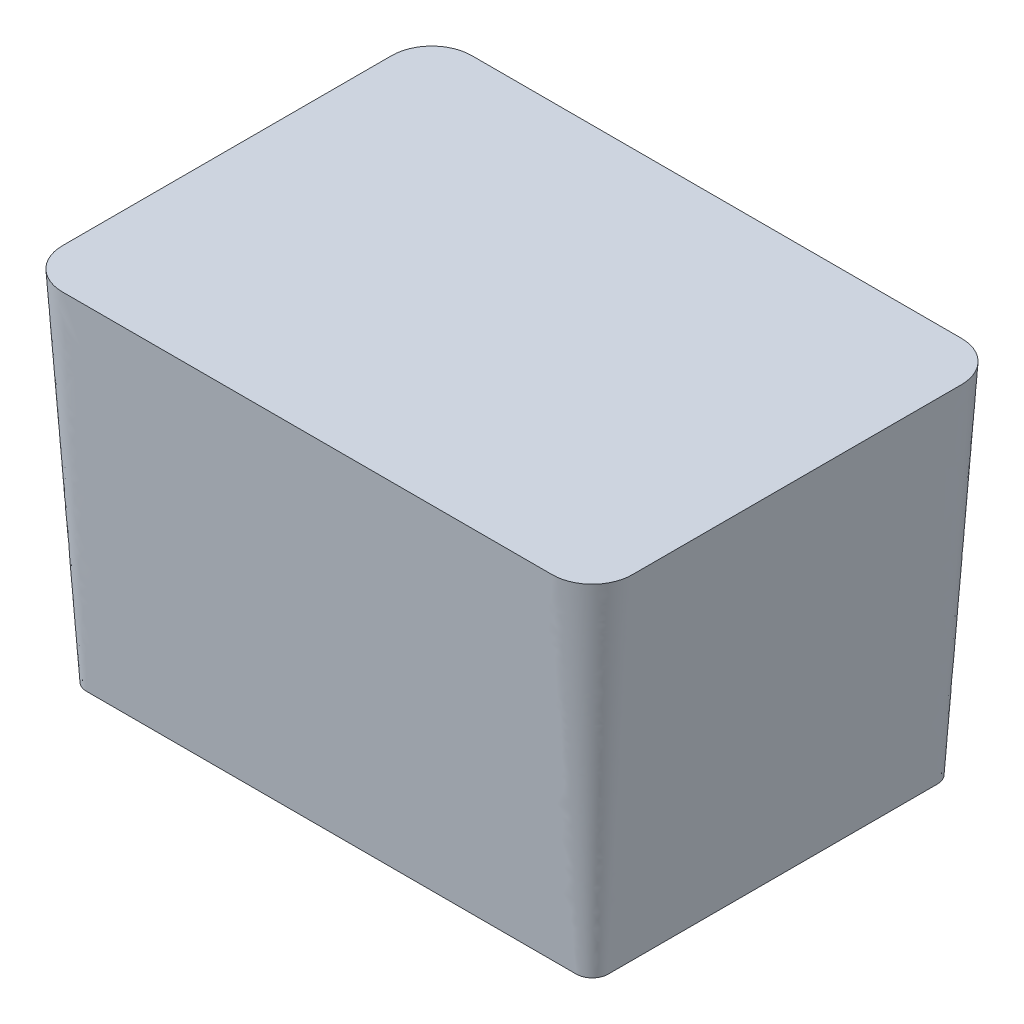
ISO-10303-21;
HEADER;
FILE_DESCRIPTION(('STEP AP214'),'2;1');
FILE_NAME('part.step','',(''),(''),'','','');
FILE_SCHEMA(('AUTOMOTIVE_DESIGN { 1 0 10303 214 1 1 1 1 }'));
ENDSEC;
DATA;
#1=APPLICATION_CONTEXT('core data for automotive mechanical design processes');
#2=APPLICATION_PROTOCOL_DEFINITION('international standard','automotive_design',2000,#1);
#3=PRODUCT_CONTEXT('',#1,'mechanical');
#4=PRODUCT('Part','Part','',(#3));
#5=PRODUCT_RELATED_PRODUCT_CATEGORY('part','',(#4));
#6=PRODUCT_DEFINITION_FORMATION('','',#4);
#7=PRODUCT_DEFINITION_CONTEXT('part definition',#1,'design');
#8=PRODUCT_DEFINITION('design','',#6,#7);
#9=PRODUCT_DEFINITION_SHAPE('','',#8);
#10=(LENGTH_UNIT() NAMED_UNIT(*) SI_UNIT(.MILLI.,.METRE.));
#11=(NAMED_UNIT(*) PLANE_ANGLE_UNIT() SI_UNIT($,.RADIAN.));
#12=(NAMED_UNIT(*) SI_UNIT($,.STERADIAN.) SOLID_ANGLE_UNIT());
#13=UNCERTAINTY_MEASURE_WITH_UNIT(LENGTH_MEASURE(1.E-05),#10,'distance_accuracy_value','');
#14=(GEOMETRIC_REPRESENTATION_CONTEXT(3) GLOBAL_UNCERTAINTY_ASSIGNED_CONTEXT((#13)) GLOBAL_UNIT_ASSIGNED_CONTEXT((#10,
#11,#12)) REPRESENTATION_CONTEXT('',''));
#15=CARTESIAN_POINT('',(0.,0.,0.));
#16=DIRECTION('',(0.,0.,1.));
#17=DIRECTION('',(1.,0.,0.));
#18=AXIS2_PLACEMENT_3D('',#15,#16,#17);
#19=CARTESIAN_POINT('',(193.675,283.21,-130.175));
#20=DIRECTION('',(0.,1.,0.));
#21=DIRECTION('',(0.,0.,1.));
#22=AXIS2_PLACEMENT_3D('',#19,#20,#21);
#23=PLANE('',#22);
#24=CARTESIAN_POINT('',(193.675,283.21,-130.175));
#25=DIRECTION('',(0.,1.,0.));
#26=DIRECTION('',(0.,0.,1.));
#27=AXIS2_PLACEMENT_3D('',#24,#25,#26);
#28=CIRCLE('',#27,31.75);
#29=CARTESIAN_POINT('',(225.425,283.21,-130.175));
#30=VERTEX_POINT('',#29);
#31=CARTESIAN_POINT('',(193.674999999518,283.21,-161.925));
#32=VERTEX_POINT('',#31);
#33=EDGE_CURVE('E306',#30,#32,#28,.T.);
#34=ORIENTED_EDGE('',*,*,#33,.T.);
#35=DIRECTION('',(-1.,0.,0.));
#36=VECTOR('',#35,1.);
#37=CARTESIAN_POINT('',(193.675,283.21,-161.925));
#38=LINE('',#37,#36);
#39=CARTESIAN_POINT('',(-193.67500000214,283.21,-161.925));
#40=VERTEX_POINT('',#39);
#41=EDGE_CURVE('E532',#32,#40,#38,.T.);
#42=ORIENTED_EDGE('',*,*,#41,.T.);
#43=CARTESIAN_POINT('',(-193.675,283.21,-130.175));
#44=DIRECTION('',(0.,1.,0.));
#45=DIRECTION('',(0.,0.,1.));
#46=AXIS2_PLACEMENT_3D('',#43,#44,#45);
#47=CIRCLE('',#46,31.75);
#48=CARTESIAN_POINT('',(-225.425,283.21,-130.174999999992));
#49=VERTEX_POINT('',#48);
#50=EDGE_CURVE('E523',#40,#49,#47,.T.);
#51=ORIENTED_EDGE('',*,*,#50,.T.);
#52=DIRECTION('',(0.,0.,1.));
#53=VECTOR('',#52,1.);
#54=CARTESIAN_POINT('',(-225.425,283.21,-130.175));
#55=LINE('',#54,#53);
#56=CARTESIAN_POINT('',(-225.425,283.21,130.174999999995));
#57=VERTEX_POINT('',#56);
#58=EDGE_CURVE('E514',#49,#57,#55,.T.);
#59=ORIENTED_EDGE('',*,*,#58,.T.);
#60=CARTESIAN_POINT('',(-193.675,283.21,130.175));
#61=DIRECTION('',(0.,1.,0.));
#62=DIRECTION('',(0.,0.,1.));
#63=AXIS2_PLACEMENT_3D('',#60,#61,#62);
#64=CIRCLE('',#63,31.75);
#65=CARTESIAN_POINT('',(-193.674999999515,283.21,161.925));
#66=VERTEX_POINT('',#65);
#67=EDGE_CURVE('E505',#57,#66,#64,.T.);
#68=ORIENTED_EDGE('',*,*,#67,.T.);
#69=DIRECTION('',(1.,0.,0.));
#70=VECTOR('',#69,1.);
#71=CARTESIAN_POINT('',(-193.675,283.21,161.925));
#72=LINE('',#71,#70);
#73=CARTESIAN_POINT('',(193.67500000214,283.21,161.925));
#74=VERTEX_POINT('',#73);
#75=EDGE_CURVE('E499',#66,#74,#72,.T.);
#76=ORIENTED_EDGE('',*,*,#75,.T.);
#77=CARTESIAN_POINT('',(193.675,283.21,130.175));
#78=DIRECTION('',(0.,1.,0.));
#79=DIRECTION('',(0.,0.,1.));
#80=AXIS2_PLACEMENT_3D('',#77,#78,#79);
#81=CIRCLE('',#80,31.75);
#82=CARTESIAN_POINT('',(225.425,283.21,130.175));
#83=VERTEX_POINT('',#82);
#84=EDGE_CURVE('E238',#74,#83,#81,.T.);
#85=ORIENTED_EDGE('',*,*,#84,.T.);
#86=DIRECTION('',(0.,0.,-1.));
#87=VECTOR('',#86,1.);
#88=CARTESIAN_POINT('',(225.425,283.21,130.175));
#89=LINE('',#88,#87);
#90=EDGE_CURVE('E12',#83,#30,#89,.T.);
#91=ORIENTED_EDGE('',*,*,#90,.T.);
#92=EDGE_LOOP('',(#34,#42,#51,#59,#68,#76,#85,#91));
#93=FACE_BOUND('',#92,.T.);
#94=ADVANCED_FACE('F228',(#93),#23,.T.);
#95=CARTESIAN_POINT('',(193.675,0.,-130.175));
#96=DIRECTION('',(0.,-1.,0.));
#97=DIRECTION('',(0.,0.,-1.));
#98=AXIS2_PLACEMENT_3D('',#95,#96,#97);
#99=PLANE('',#98);
#100=CARTESIAN_POINT('',(193.675,0.,-130.175));
#101=DIRECTION('',(0.,1.,0.));
#102=DIRECTION('',(0.,0.,-1.));
#103=AXIS2_PLACEMENT_3D('',#100,#101,#102);
#104=CIRCLE('',#103,12.7);
#105=CARTESIAN_POINT('',(206.375,0.,-130.174999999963));
#106=VERTEX_POINT('',#105);
#107=CARTESIAN_POINT('',(193.675,0.,-142.875));
#108=VERTEX_POINT('',#107);
#109=EDGE_CURVE('E299',#106,#108,#104,.T.);
#110=ORIENTED_EDGE('',*,*,#109,.F.);
#111=DIRECTION('',(0.,0.,-1.));
#112=VECTOR('',#111,1.);
#113=CARTESIAN_POINT('',(206.375,0.,-130.175));
#114=LINE('',#113,#112);
#115=CARTESIAN_POINT('',(206.375,0.,130.174999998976));
#116=VERTEX_POINT('',#115);
#117=EDGE_CURVE('E312',#116,#106,#114,.T.);
#118=ORIENTED_EDGE('',*,*,#117,.F.);
#119=CARTESIAN_POINT('',(193.675,0.,130.175));
#120=DIRECTION('',(0.,1.,0.));
#121=DIRECTION('',(0.,0.,-1.));
#122=AXIS2_PLACEMENT_3D('',#119,#120,#121);
#123=CIRCLE('',#122,12.7);
#124=CARTESIAN_POINT('',(193.675000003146,0.,142.875));
#125=VERTEX_POINT('',#124);
#126=EDGE_CURVE('E456',#125,#116,#123,.T.);
#127=ORIENTED_EDGE('',*,*,#126,.F.);
#128=DIRECTION('',(1.,0.,0.));
#129=VECTOR('',#128,1.);
#130=CARTESIAN_POINT('',(193.675,0.,142.875));
#131=LINE('',#130,#129);
#132=CARTESIAN_POINT('',(-193.67500000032,0.,142.875));
#133=VERTEX_POINT('',#132);
#134=EDGE_CURVE('E447',#133,#125,#131,.T.);
#135=ORIENTED_EDGE('',*,*,#134,.F.);
#136=CARTESIAN_POINT('',(-193.675,0.,130.175));
#137=DIRECTION('',(0.,1.,0.));
#138=DIRECTION('',(0.,0.,-1.));
#139=AXIS2_PLACEMENT_3D('',#136,#137,#138);
#140=CIRCLE('',#139,12.7);
#141=CARTESIAN_POINT('',(-206.375,0.,130.174999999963));
#142=VERTEX_POINT('',#141);
#143=EDGE_CURVE('E438',#142,#133,#140,.T.);
#144=ORIENTED_EDGE('',*,*,#143,.F.);
#145=DIRECTION('',(0.,0.,1.));
#146=VECTOR('',#145,1.);
#147=CARTESIAN_POINT('',(-206.375,0.,-130.175));
#148=LINE('',#147,#146);
#149=CARTESIAN_POINT('',(-206.375,0.,-130.175));
#150=VERTEX_POINT('',#149);
#151=EDGE_CURVE('E432',#150,#142,#148,.T.);
#152=ORIENTED_EDGE('',*,*,#151,.F.);
#153=CARTESIAN_POINT('',(-193.675,0.,-130.175));
#154=DIRECTION('',(0.,1.,0.));
#155=DIRECTION('',(0.,0.,1.));
#156=AXIS2_PLACEMENT_3D('',#153,#154,#155);
#157=CIRCLE('',#156,12.7);
#158=CARTESIAN_POINT('',(-193.675,0.,-142.875));
#159=VERTEX_POINT('',#158);
#160=EDGE_CURVE('E302',#159,#150,#157,.T.);
#161=ORIENTED_EDGE('',*,*,#160,.F.);
#162=DIRECTION('',(-1.,0.,0.));
#163=VECTOR('',#162,1.);
#164=CARTESIAN_POINT('',(193.675,0.,-142.875));
#165=LINE('',#164,#163);
#166=EDGE_CURVE('E294',#108,#159,#165,.T.);
#167=ORIENTED_EDGE('',*,*,#166,.F.);
#168=EDGE_LOOP('',(#110,#118,#127,#135,#144,#152,#161,#167));
#169=FACE_BOUND('',#168,.T.);
#170=ADVANCED_FACE('F297',(#169),#99,.T.);
#171=CARTESIAN_POINT('',(193.674999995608,0.,-142.875));
#172=CARTESIAN_POINT('',(193.674999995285,283.21,-161.925));
#173=CARTESIAN_POINT('',(162.493493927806,0.,-142.875));
#174=CARTESIAN_POINT('',(160.202634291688,283.21,-161.925));
#175=CARTESIAN_POINT('',(98.5698908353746,0.,-142.875));
#176=CARTESIAN_POINT('',(95.1419816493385,283.21,-161.925));
#177=CARTESIAN_POINT('',(0.,0.,-142.875));
#178=CARTESIAN_POINT('',(0.,283.21,-161.925));
#179=CARTESIAN_POINT('',(-98.5698908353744,0.,-142.875));
#180=CARTESIAN_POINT('',(-95.1419816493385,283.21,-161.925));
#181=CARTESIAN_POINT('',(-162.493493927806,0.,-142.875));
#182=CARTESIAN_POINT('',(-160.202634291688,283.21,-161.925));
#183=CARTESIAN_POINT('',(-194.365021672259,0.,-142.875));
#184=CARTESIAN_POINT('',(-194.415716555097,283.21,-161.925));
#185=CARTESIAN_POINT('',(-195.493647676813,0.,-142.773203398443));
#186=CARTESIAN_POINT('',(-195.953024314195,283.21,-161.874146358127));
#187=CARTESIAN_POINT('',(-196.898443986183,0.,-142.484520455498));
#188=CARTESIAN_POINT('',(-198.436983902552,283.21,-161.600970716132));
#189=CARTESIAN_POINT('',(-198.109637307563,0.,-142.095557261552));
#190=CARTESIAN_POINT('',(-201.109315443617,283.21,-161.086565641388));
#191=CARTESIAN_POINT('',(-199.196149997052,0.,-141.631659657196));
#192=CARTESIAN_POINT('',(-203.955919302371,283.21,-160.266592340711));
#193=CARTESIAN_POINT('',(-200.179914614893,0.,-141.10059156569));
#194=CARTESIAN_POINT('',(-206.962695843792,283.21,-159.07671202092));
#195=CARTESIAN_POINT('',(-201.082626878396,0.,-140.509347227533));
#196=CARTESIAN_POINT('',(-210.059449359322,283.21,-157.450659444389));
#197=CARTESIAN_POINT('',(-201.912936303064,0.,-139.859440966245));
#198=CARTESIAN_POINT('',(-213.145049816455,283.21,-155.351740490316));
#199=CARTESIAN_POINT('',(-202.67907505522,0.,-139.151639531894));
#200=CARTESIAN_POINT('',(-216.063406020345,283.21,-152.800122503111));
#201=CARTESIAN_POINT('',(-203.38438616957,0.,-138.383511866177));
#202=CARTESIAN_POINT('',(-218.65523761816,283.21,-149.898350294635));
#203=CARTESIAN_POINT('',(-204.031370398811,0.,-137.551738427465));
#204=CARTESIAN_POINT('',(-220.805614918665,283.21,-146.801925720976));
#205=CARTESIAN_POINT('',(-204.619314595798,0.,-136.648330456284));
#206=CARTESIAN_POINT('',(-222.480870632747,283.21,-143.673736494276));
#207=CARTESIAN_POINT('',(-205.146678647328,0.,-135.664617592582));
#208=CARTESIAN_POINT('',(-223.710611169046,283.21,-140.62379755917));
#209=CARTESIAN_POINT('',(-205.606618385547,0.,-134.579672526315));
#210=CARTESIAN_POINT('',(-224.558484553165,283.21,-137.731277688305));
#211=CARTESIAN_POINT('',(-205.991230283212,0.,-133.371503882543));
#212=CARTESIAN_POINT('',(-225.090484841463,283.21,-135.013744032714));
#213=CARTESIAN_POINT('',(-206.275780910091,0.,-131.974123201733));
#214=CARTESIAN_POINT('',(-225.372606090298,283.21,-132.48876374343));
#215=CARTESIAN_POINT('',(-206.375,0.,-130.854551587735));
#216=CARTESIAN_POINT('',(-225.425,283.21,-130.92709793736));
#217=CARTESIAN_POINT('',(-206.375,0.,-109.534946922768));
#218=CARTESIAN_POINT('',(-225.425,283.21,-107.331493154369));
#219=CARTESIAN_POINT('',(-206.375,0.,-66.7913097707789));
#220=CARTESIAN_POINT('',(-225.425,283.21,-63.4937216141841));
#221=CARTESIAN_POINT('',(-206.375,0.,0.));
#222=CARTESIAN_POINT('',(-225.425,283.21,1.31838984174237E-13));
#223=CARTESIAN_POINT('',(-206.375,0.,66.7913097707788));
#224=CARTESIAN_POINT('',(-225.425,283.21,63.493721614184));
#225=CARTESIAN_POINT('',(-206.375,0.,109.534946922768));
#226=CARTESIAN_POINT('',(-225.425,283.21,107.331493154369));
#227=CARTESIAN_POINT('',(-206.375,0.,130.854551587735));
#228=CARTESIAN_POINT('',(-225.425,283.21,130.92709793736));
#229=CARTESIAN_POINT('',(-206.275780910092,0.,131.974123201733));
#230=CARTESIAN_POINT('',(-225.372606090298,283.21,132.48876374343));
#231=CARTESIAN_POINT('',(-205.991230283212,0.,133.371503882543));
#232=CARTESIAN_POINT('',(-225.090484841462,283.21,135.013744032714));
#233=CARTESIAN_POINT('',(-205.606618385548,0.,134.579672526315));
#234=CARTESIAN_POINT('',(-224.558484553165,283.21,137.731277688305));
#235=CARTESIAN_POINT('',(-205.146678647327,0.,135.664617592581));
#236=CARTESIAN_POINT('',(-223.710611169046,283.21,140.62379755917));
#237=CARTESIAN_POINT('',(-204.619314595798,0.,136.648330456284));
#238=CARTESIAN_POINT('',(-222.480870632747,283.21,143.673736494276));
#239=CARTESIAN_POINT('',(-204.031370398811,0.,137.551738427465));
#240=CARTESIAN_POINT('',(-220.805614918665,283.21,146.801925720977));
#241=CARTESIAN_POINT('',(-203.38438616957,0.,138.383511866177));
#242=CARTESIAN_POINT('',(-218.65523761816,283.21,149.898350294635));
#243=CARTESIAN_POINT('',(-202.67907505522,0.,139.151639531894));
#244=CARTESIAN_POINT('',(-216.063406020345,283.21,152.800122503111));
#245=CARTESIAN_POINT('',(-201.912936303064,0.,139.859440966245));
#246=CARTESIAN_POINT('',(-213.145049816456,283.209999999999,155.351740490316));
#247=CARTESIAN_POINT('',(-201.082626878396,0.,140.509347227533));
#248=CARTESIAN_POINT('',(-210.059449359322,283.210000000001,157.450659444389));
#249=CARTESIAN_POINT('',(-200.179914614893,0.,141.10059156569));
#250=CARTESIAN_POINT('',(-206.962695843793,283.21,159.07671202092));
#251=CARTESIAN_POINT('',(-199.196149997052,0.,141.631659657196));
#252=CARTESIAN_POINT('',(-203.955919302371,283.21,160.266592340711));
#253=CARTESIAN_POINT('',(-198.109637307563,0.,142.095557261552));
#254=CARTESIAN_POINT('',(-201.109315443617,283.21,161.086565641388));
#255=CARTESIAN_POINT('',(-196.898443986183,0.,142.484520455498));
#256=CARTESIAN_POINT('',(-198.436983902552,283.21,161.600970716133));
#257=CARTESIAN_POINT('',(-195.493647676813,0.,142.773203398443));
#258=CARTESIAN_POINT('',(-195.953024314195,283.21,161.874146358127));
#259=CARTESIAN_POINT('',(-194.365021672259,0.,142.875));
#260=CARTESIAN_POINT('',(-194.415716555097,283.21,161.925));
#261=CARTESIAN_POINT('',(-162.493493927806,0.,142.875));
#262=CARTESIAN_POINT('',(-160.202634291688,283.21,161.925));
#263=CARTESIAN_POINT('',(-98.5698908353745,0.,142.875));
#264=CARTESIAN_POINT('',(-95.1419816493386,283.21,161.925));
#265=CARTESIAN_POINT('',(0.,0.,142.875));
#266=CARTESIAN_POINT('',(0.,283.21,161.925));
#267=CARTESIAN_POINT('',(98.5698908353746,0.,142.875));
#268=CARTESIAN_POINT('',(95.1419816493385,283.21,161.925));
#269=CARTESIAN_POINT('',(162.493493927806,0.,142.875));
#270=CARTESIAN_POINT('',(160.202634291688,283.21,161.925));
#271=CARTESIAN_POINT('',(194.36502167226,0.,142.875));
#272=CARTESIAN_POINT('',(194.415716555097,283.21,161.925));
#273=CARTESIAN_POINT('',(195.493647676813,0.,142.773203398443));
#274=CARTESIAN_POINT('',(195.953024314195,283.21,161.874146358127));
#275=CARTESIAN_POINT('',(196.898443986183,0.,142.484520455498));
#276=CARTESIAN_POINT('',(198.436983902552,283.21,161.600970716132));
#277=CARTESIAN_POINT('',(198.109637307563,0.,142.095557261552));
#278=CARTESIAN_POINT('',(201.109315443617,283.21,161.086565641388));
#279=CARTESIAN_POINT('',(199.196149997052,0.,141.631659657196));
#280=CARTESIAN_POINT('',(203.955919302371,283.21,160.266592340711));
#281=CARTESIAN_POINT('',(200.179914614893,0.,141.10059156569));
#282=CARTESIAN_POINT('',(206.962695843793,283.21,159.07671202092));
#283=CARTESIAN_POINT('',(201.082626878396,0.,140.509347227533));
#284=CARTESIAN_POINT('',(210.059449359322,283.21,157.450659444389));
#285=CARTESIAN_POINT('',(201.912936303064,0.,139.859440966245));
#286=CARTESIAN_POINT('',(213.145049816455,283.21,155.351740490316));
#287=CARTESIAN_POINT('',(202.67907505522,0.,139.151639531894));
#288=CARTESIAN_POINT('',(216.063406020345,283.21,152.800122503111));
#289=CARTESIAN_POINT('',(203.384386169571,0.,138.383511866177));
#290=CARTESIAN_POINT('',(218.65523761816,283.21,149.898350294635));
#291=CARTESIAN_POINT('',(204.031370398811,0.,137.551738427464));
#292=CARTESIAN_POINT('',(220.805614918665,283.21,146.801925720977));
#293=CARTESIAN_POINT('',(204.619314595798,0.,136.648330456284));
#294=CARTESIAN_POINT('',(222.480870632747,283.21,143.673736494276));
#295=CARTESIAN_POINT('',(205.146678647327,0.,135.664617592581));
#296=CARTESIAN_POINT('',(223.710611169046,283.21,140.62379755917));
#297=CARTESIAN_POINT('',(205.606618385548,0.,134.579672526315));
#298=CARTESIAN_POINT('',(224.558484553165,283.21,137.731277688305));
#299=CARTESIAN_POINT('',(205.991230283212,0.,133.371503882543));
#300=CARTESIAN_POINT('',(225.090484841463,283.21,135.013744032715));
#301=CARTESIAN_POINT('',(206.275780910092,0.,131.974123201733));
#302=CARTESIAN_POINT('',(225.372606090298,283.21,132.48876374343));
#303=CARTESIAN_POINT('',(206.375,0.,130.854551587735));
#304=CARTESIAN_POINT('',(225.425,283.21,130.92709793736));
#305=CARTESIAN_POINT('',(206.375,0.,109.534946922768));
#306=CARTESIAN_POINT('',(225.425,283.21,107.331493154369));
#307=CARTESIAN_POINT('',(206.375,0.,66.7913097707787));
#308=CARTESIAN_POINT('',(225.425,283.21,63.4937216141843));
#309=CARTESIAN_POINT('',(206.375,0.,0.));
#310=CARTESIAN_POINT('',(225.425,283.21,0.));
#311=CARTESIAN_POINT('',(206.375,0.,-66.7913097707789));
#312=CARTESIAN_POINT('',(225.425,283.21,-63.4937216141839));
#313=CARTESIAN_POINT('',(206.375,0.,-109.534946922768));
#314=CARTESIAN_POINT('',(225.425,283.21,-107.331493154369));
#315=CARTESIAN_POINT('',(206.375,0.,-130.854551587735));
#316=CARTESIAN_POINT('',(225.425,283.21,-130.92709793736));
#317=CARTESIAN_POINT('',(206.275780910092,0.,-131.974123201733));
#318=CARTESIAN_POINT('',(225.372606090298,283.21,-132.48876374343));
#319=CARTESIAN_POINT('',(205.991230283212,0.,-133.371503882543));
#320=CARTESIAN_POINT('',(225.090484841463,283.21,-135.013744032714));
#321=CARTESIAN_POINT('',(205.606618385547,0.,-134.579672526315));
#322=CARTESIAN_POINT('',(224.558484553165,283.21,-137.731277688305));
#323=CARTESIAN_POINT('',(205.146678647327,0.,-135.664617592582));
#324=CARTESIAN_POINT('',(223.710611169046,283.21,-140.62379755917));
#325=CARTESIAN_POINT('',(204.619314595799,0.,-136.648330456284));
#326=CARTESIAN_POINT('',(222.480870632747,283.209999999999,-143.673736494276));
#327=CARTESIAN_POINT('',(204.03137039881,0.,-137.551738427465));
#328=CARTESIAN_POINT('',(220.805614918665,283.210000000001,-146.801925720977));
#329=CARTESIAN_POINT('',(203.384386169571,0.,-138.383511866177));
#330=CARTESIAN_POINT('',(218.655237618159,283.209999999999,-149.898350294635));
#331=CARTESIAN_POINT('',(202.67907505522,0.,-139.151639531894));
#332=CARTESIAN_POINT('',(216.063406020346,283.210000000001,-152.800122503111));
#333=CARTESIAN_POINT('',(201.912936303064,0.,-139.859440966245));
#334=CARTESIAN_POINT('',(213.145049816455,283.209999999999,-155.351740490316));
#335=CARTESIAN_POINT('',(201.082626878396,0.,-140.509347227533));
#336=CARTESIAN_POINT('',(210.059449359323,283.210000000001,-157.450659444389));
#337=CARTESIAN_POINT('',(200.179914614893,0.,-141.10059156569));
#338=CARTESIAN_POINT('',(206.962695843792,283.21,-159.07671202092));
#339=CARTESIAN_POINT('',(199.196149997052,0.,-141.631659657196));
#340=CARTESIAN_POINT('',(203.955919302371,283.21,-160.266592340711));
#341=CARTESIAN_POINT('',(198.109637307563,0.,-142.095557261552));
#342=CARTESIAN_POINT('',(201.109315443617,283.21,-161.086565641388));
#343=CARTESIAN_POINT('',(196.898443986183,0.,-142.484520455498));
#344=CARTESIAN_POINT('',(198.436983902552,283.21,-161.600970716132));
#345=CARTESIAN_POINT('',(195.493647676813,0.,-142.773203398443));
#346=CARTESIAN_POINT('',(195.953024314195,283.21,-161.874146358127));
#347=CARTESIAN_POINT('',(194.36502167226,0.,-142.875));
#348=CARTESIAN_POINT('',(194.415716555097,283.21,-161.925));
#349=CARTESIAN_POINT('',(193.674999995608,0.,-142.875));
#350=CARTESIAN_POINT('',(193.674999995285,283.21,-161.925));
#351=B_SPLINE_SURFACE_WITH_KNOTS('',3,1,((#171,#172),(#173,#174),(#175,#176),(#177,#178),(#179,
#180),(#181,#182),(#183,#184),(#185,#186),(#187,#188),(#189,#190),(#191,#192),(#193,#194),(#195,
#196),(#197,#198),(#199,#200),(#201,#202),(#203,#204),(#205,#206),(#207,#208),(#209,#210),(#211,
#212),(#213,#214),(#215,#216),(#217,#218),(#219,#220),(#221,#222),(#223,#224),(#225,#226),(#227,
#228),(#229,#230),(#231,#232),(#233,#234),(#235,#236),(#237,#238),(#239,#240),(#241,#242),(#243,
#244),(#245,#246),(#247,#248),(#249,#250),(#251,#252),(#253,#254),(#255,#256),(#257,#258),(#259,
#260),(#261,#262),(#263,#264),(#265,#266),(#267,#268),(#269,#270),(#271,#272),(#273,#274),(#275,
#276),(#277,#278),(#279,#280),(#281,#282),(#283,#284),(#285,#286),(#287,#288),(#289,#290),(#291,
#292),(#293,#294),(#295,#296),(#297,#298),(#299,#300),(#301,#302),(#303,#304),(#305,#306),(#307,
#308),(#309,#310),(#311,#312),(#313,#314),(#315,#316),(#317,#318),(#319,#320),(#321,#322),(#323,
#324),(#325,#326),(#327,#328),(#329,#330),(#331,#332),(#333,#334),(#335,#336),(#337,#338),(#339,
#340),(#341,#342),(#343,#344),(#345,#346),(#347,#348),(#349,#350)),.UNSPECIFIED.,.T.,.F.,.F.,(4,
1,1,1,2,1,1,1,1,1,1,1,1,1,1,1,1,1,1,1,2,1,1,1,2,1,1,1,1,1,1,1,1,1,1,1,1,1,1,1,2,1,1,1,2,1,1,1,1,
1,1,1,1,1,1,1,1,1,1,1,2,1,1,1,2,1,1,1,1,1,1,1,1,1,1,1,1,1,1,1,4),(2,2),(0.,0.0675980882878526,
0.135196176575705,0.202794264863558,0.270392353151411,0.271888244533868,0.273384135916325,
0.274880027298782,0.276375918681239,0.277871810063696,0.279367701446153,0.28086359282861,
0.282359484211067,0.283855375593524,0.285351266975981,0.286847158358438,0.288343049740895,
0.289838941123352,0.291334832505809,0.292830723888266,0.294326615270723,0.339761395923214,
0.385196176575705,0.430630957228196,0.476065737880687,0.477561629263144,0.479057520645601,
0.480553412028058,0.482049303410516,0.483545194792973,0.48504108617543,0.486536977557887,
0.488032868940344,0.489528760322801,0.491024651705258,0.492520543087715,0.494016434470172,
0.495512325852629,0.497008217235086,0.498504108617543,0.5,0.567598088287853,0.635196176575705,
0.702794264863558,0.770392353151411,0.771888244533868,0.773384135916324,0.774880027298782,
0.776375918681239,0.777871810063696,0.779367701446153,0.78086359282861,0.782359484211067,
0.783855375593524,0.785351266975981,0.786847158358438,0.788343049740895,0.789838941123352,
0.791334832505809,0.792830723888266,0.794326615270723,0.839761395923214,0.885196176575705,
0.930630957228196,0.976065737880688,0.977561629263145,0.979057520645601,0.980553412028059,
0.982049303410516,0.983545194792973,0.98504108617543,0.986536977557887,0.988032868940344,
0.989528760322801,0.991024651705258,0.992520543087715,0.994016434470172,0.995512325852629,
0.997008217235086,0.998504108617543,1.),(0.,1.),.UNSPECIFIED.);
#352=CARTESIAN_POINT('',(0.,0.,142.875));
#353=CARTESIAN_POINT('',(0.,283.21,161.925));
#354=CARTESIAN_POINT('',(32.8566302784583,0.,142.875));
#355=CARTESIAN_POINT('',(31.7139938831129,283.21,161.925));
#356=CARTESIAN_POINT('',(98.5698908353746,0.,142.875));
#357=CARTESIAN_POINT('',(95.1419816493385,283.21,161.925));
#358=CARTESIAN_POINT('',(162.493493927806,0.,142.875));
#359=CARTESIAN_POINT('',(160.202634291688,283.21,161.925));
#360=CARTESIAN_POINT('',(194.36502167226,0.,142.875));
#361=CARTESIAN_POINT('',(194.415716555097,283.21,161.925));
#362=CARTESIAN_POINT('',(195.493647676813,0.,142.773203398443));
#363=CARTESIAN_POINT('',(195.953024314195,283.21,161.874146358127));
#364=CARTESIAN_POINT('',(196.898443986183,0.,142.484520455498));
#365=CARTESIAN_POINT('',(198.436983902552,283.21,161.600970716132));
#366=CARTESIAN_POINT('',(198.109637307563,0.,142.095557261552));
#367=CARTESIAN_POINT('',(201.109315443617,283.21,161.086565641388));
#368=CARTESIAN_POINT('',(199.196149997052,0.,141.631659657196));
#369=CARTESIAN_POINT('',(203.955919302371,283.21,160.266592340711));
#370=CARTESIAN_POINT('',(200.179914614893,0.,141.10059156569));
#371=CARTESIAN_POINT('',(206.962695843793,283.21,159.07671202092));
#372=CARTESIAN_POINT('',(201.082626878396,0.,140.509347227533));
#373=CARTESIAN_POINT('',(210.059449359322,283.21,157.450659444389));
#374=CARTESIAN_POINT('',(201.912936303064,0.,139.859440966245));
#375=CARTESIAN_POINT('',(213.145049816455,283.21,155.351740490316));
#376=CARTESIAN_POINT('',(202.67907505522,0.,139.151639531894));
#377=CARTESIAN_POINT('',(216.063406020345,283.21,152.800122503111));
#378=CARTESIAN_POINT('',(203.384386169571,0.,138.383511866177));
#379=CARTESIAN_POINT('',(218.65523761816,283.21,149.898350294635));
#380=CARTESIAN_POINT('',(204.031370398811,0.,137.551738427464));
#381=CARTESIAN_POINT('',(220.805614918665,283.21,146.801925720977));
#382=CARTESIAN_POINT('',(204.619314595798,0.,136.648330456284));
#383=CARTESIAN_POINT('',(222.480870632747,283.21,143.673736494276));
#384=CARTESIAN_POINT('',(205.146678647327,0.,135.664617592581));
#385=CARTESIAN_POINT('',(223.710611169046,283.21,140.62379755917));
#386=CARTESIAN_POINT('',(205.606618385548,0.,134.579672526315));
#387=CARTESIAN_POINT('',(224.558484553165,283.21,137.731277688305));
#388=CARTESIAN_POINT('',(205.991230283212,0.,133.371503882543));
#389=CARTESIAN_POINT('',(225.090484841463,283.21,135.013744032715));
#390=CARTESIAN_POINT('',(206.275780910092,0.,131.974123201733));
#391=CARTESIAN_POINT('',(225.372606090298,283.21,132.48876374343));
#392=CARTESIAN_POINT('',(206.375,0.,130.854551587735));
#393=CARTESIAN_POINT('',(225.425,283.21,130.92709793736));
#394=CARTESIAN_POINT('',(206.375,0.,109.534946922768));
#395=CARTESIAN_POINT('',(225.425,283.21,107.331493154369));
#396=CARTESIAN_POINT('',(206.375,0.,66.7913097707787));
#397=CARTESIAN_POINT('',(225.425,283.21,63.4937216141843));
#398=CARTESIAN_POINT('',(206.375,0.,0.));
#399=CARTESIAN_POINT('',(225.425,283.21,0.));
#400=CARTESIAN_POINT('',(206.375,0.,-66.7913097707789));
#401=CARTESIAN_POINT('',(225.425,283.21,-63.4937216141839));
#402=CARTESIAN_POINT('',(206.375,0.,-109.534946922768));
#403=CARTESIAN_POINT('',(225.425,283.21,-107.331493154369));
#404=CARTESIAN_POINT('',(206.375,0.,-130.854551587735));
#405=CARTESIAN_POINT('',(225.425,283.21,-130.92709793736));
#406=CARTESIAN_POINT('',(206.275780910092,0.,-131.974123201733));
#407=CARTESIAN_POINT('',(225.372606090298,283.21,-132.48876374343));
#408=CARTESIAN_POINT('',(205.991230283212,0.,-133.371503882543));
#409=CARTESIAN_POINT('',(225.090484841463,283.21,-135.013744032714));
#410=CARTESIAN_POINT('',(205.606618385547,0.,-134.579672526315));
#411=CARTESIAN_POINT('',(224.558484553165,283.21,-137.731277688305));
#412=CARTESIAN_POINT('',(205.146678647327,0.,-135.664617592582));
#413=CARTESIAN_POINT('',(223.710611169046,283.21,-140.62379755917));
#414=CARTESIAN_POINT('',(204.619314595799,0.,-136.648330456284));
#415=CARTESIAN_POINT('',(222.480870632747,283.209999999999,-143.673736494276));
#416=CARTESIAN_POINT('',(204.03137039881,0.,-137.551738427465));
#417=CARTESIAN_POINT('',(220.805614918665,283.210000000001,-146.801925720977));
#418=CARTESIAN_POINT('',(203.384386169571,0.,-138.383511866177));
#419=CARTESIAN_POINT('',(218.655237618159,283.209999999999,-149.898350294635));
#420=CARTESIAN_POINT('',(202.67907505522,0.,-139.151639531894));
#421=CARTESIAN_POINT('',(216.063406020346,283.210000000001,-152.800122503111));
#422=CARTESIAN_POINT('',(201.912936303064,0.,-139.859440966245));
#423=CARTESIAN_POINT('',(213.145049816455,283.209999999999,-155.351740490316));
#424=CARTESIAN_POINT('',(201.082626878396,0.,-140.509347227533));
#425=CARTESIAN_POINT('',(210.059449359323,283.210000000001,-157.450659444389));
#426=CARTESIAN_POINT('',(200.179914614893,0.,-141.10059156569));
#427=CARTESIAN_POINT('',(206.962695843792,283.21,-159.07671202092));
#428=CARTESIAN_POINT('',(199.196149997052,0.,-141.631659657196));
#429=CARTESIAN_POINT('',(203.955919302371,283.21,-160.266592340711));
#430=CARTESIAN_POINT('',(198.109637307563,0.,-142.095557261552));
#431=CARTESIAN_POINT('',(201.109315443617,283.21,-161.086565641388));
#432=CARTESIAN_POINT('',(196.898443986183,0.,-142.484520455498));
#433=CARTESIAN_POINT('',(198.436983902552,283.21,-161.600970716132));
#434=CARTESIAN_POINT('',(195.493647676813,0.,-142.773203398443));
#435=CARTESIAN_POINT('',(195.953024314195,283.21,-161.874146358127));
#436=CARTESIAN_POINT('',(194.36502167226,0.,-142.875));
#437=CARTESIAN_POINT('',(194.415716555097,283.21,-161.925));
#438=CARTESIAN_POINT('',(162.493493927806,0.,-142.875));
#439=CARTESIAN_POINT('',(160.202634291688,283.21,-161.925));
#440=CARTESIAN_POINT('',(98.5698908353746,0.,-142.875));
#441=CARTESIAN_POINT('',(95.1419816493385,283.21,-161.925));
#442=CARTESIAN_POINT('',(0.,0.,-142.875));
#443=CARTESIAN_POINT('',(0.,283.21,-161.925));
#444=CARTESIAN_POINT('',(-98.5698908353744,0.,-142.875));
#445=CARTESIAN_POINT('',(-95.1419816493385,283.21,-161.925));
#446=CARTESIAN_POINT('',(-162.493493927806,0.,-142.875));
#447=CARTESIAN_POINT('',(-160.202634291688,283.21,-161.925));
#448=CARTESIAN_POINT('',(-194.365021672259,0.,-142.875));
#449=CARTESIAN_POINT('',(-194.415716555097,283.21,-161.925));
#450=CARTESIAN_POINT('',(-195.493647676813,0.,-142.773203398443));
#451=CARTESIAN_POINT('',(-195.953024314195,283.21,-161.874146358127));
#452=CARTESIAN_POINT('',(-196.898443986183,0.,-142.484520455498));
#453=CARTESIAN_POINT('',(-198.436983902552,283.21,-161.600970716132));
#454=CARTESIAN_POINT('',(-198.109637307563,0.,-142.095557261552));
#455=CARTESIAN_POINT('',(-201.109315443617,283.21,-161.086565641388));
#456=CARTESIAN_POINT('',(-199.196149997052,0.,-141.631659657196));
#457=CARTESIAN_POINT('',(-203.955919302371,283.21,-160.266592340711));
#458=CARTESIAN_POINT('',(-200.179914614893,0.,-141.10059156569));
#459=CARTESIAN_POINT('',(-206.962695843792,283.21,-159.07671202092));
#460=CARTESIAN_POINT('',(-201.082626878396,0.,-140.509347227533));
#461=CARTESIAN_POINT('',(-210.059449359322,283.21,-157.450659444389));
#462=CARTESIAN_POINT('',(-201.912936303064,0.,-139.859440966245));
#463=CARTESIAN_POINT('',(-213.145049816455,283.21,-155.351740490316));
#464=CARTESIAN_POINT('',(-202.67907505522,0.,-139.151639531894));
#465=CARTESIAN_POINT('',(-216.063406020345,283.21,-152.800122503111));
#466=CARTESIAN_POINT('',(-203.38438616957,0.,-138.383511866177));
#467=CARTESIAN_POINT('',(-218.65523761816,283.21,-149.898350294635));
#468=CARTESIAN_POINT('',(-204.031370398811,0.,-137.551738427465));
#469=CARTESIAN_POINT('',(-220.805614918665,283.21,-146.801925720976));
#470=CARTESIAN_POINT('',(-204.619314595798,0.,-136.648330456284));
#471=CARTESIAN_POINT('',(-222.480870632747,283.21,-143.673736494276));
#472=CARTESIAN_POINT('',(-205.146678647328,0.,-135.664617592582));
#473=CARTESIAN_POINT('',(-223.710611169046,283.21,-140.62379755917));
#474=CARTESIAN_POINT('',(-205.606618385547,0.,-134.579672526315));
#475=CARTESIAN_POINT('',(-224.558484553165,283.21,-137.731277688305));
#476=CARTESIAN_POINT('',(-205.991230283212,0.,-133.371503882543));
#477=CARTESIAN_POINT('',(-225.090484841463,283.21,-135.013744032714));
#478=CARTESIAN_POINT('',(-206.275780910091,0.,-131.974123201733));
#479=CARTESIAN_POINT('',(-225.372606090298,283.21,-132.48876374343));
#480=CARTESIAN_POINT('',(-206.375,0.,-130.854551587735));
#481=CARTESIAN_POINT('',(-225.425,283.21,-130.92709793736));
#482=CARTESIAN_POINT('',(-206.375,0.,-109.534946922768));
#483=CARTESIAN_POINT('',(-225.425,283.21,-107.331493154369));
#484=CARTESIAN_POINT('',(-206.375,0.,-66.7913097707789));
#485=CARTESIAN_POINT('',(-225.425,283.21,-63.4937216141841));
#486=CARTESIAN_POINT('',(-206.375,0.,0.));
#487=CARTESIAN_POINT('',(-225.425,283.21,1.31838984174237E-13));
#488=CARTESIAN_POINT('',(-206.375,0.,66.7913097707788));
#489=CARTESIAN_POINT('',(-225.425,283.21,63.493721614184));
#490=CARTESIAN_POINT('',(-206.375,0.,109.534946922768));
#491=CARTESIAN_POINT('',(-225.425,283.21,107.331493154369));
#492=CARTESIAN_POINT('',(-206.375,0.,130.854551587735));
#493=CARTESIAN_POINT('',(-225.425,283.21,130.92709793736));
#494=CARTESIAN_POINT('',(-206.275780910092,0.,131.974123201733));
#495=CARTESIAN_POINT('',(-225.372606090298,283.21,132.48876374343));
#496=CARTESIAN_POINT('',(-205.991230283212,0.,133.371503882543));
#497=CARTESIAN_POINT('',(-225.090484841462,283.21,135.013744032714));
#498=CARTESIAN_POINT('',(-205.606618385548,0.,134.579672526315));
#499=CARTESIAN_POINT('',(-224.558484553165,283.21,137.731277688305));
#500=CARTESIAN_POINT('',(-205.146678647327,0.,135.664617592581));
#501=CARTESIAN_POINT('',(-223.710611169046,283.21,140.62379755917));
#502=CARTESIAN_POINT('',(-204.619314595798,0.,136.648330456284));
#503=CARTESIAN_POINT('',(-222.480870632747,283.21,143.673736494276));
#504=CARTESIAN_POINT('',(-204.031370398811,0.,137.551738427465));
#505=CARTESIAN_POINT('',(-220.805614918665,283.21,146.801925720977));
#506=CARTESIAN_POINT('',(-203.38438616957,0.,138.383511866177));
#507=CARTESIAN_POINT('',(-218.65523761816,283.21,149.898350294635));
#508=CARTESIAN_POINT('',(-202.67907505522,0.,139.151639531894));
#509=CARTESIAN_POINT('',(-216.063406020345,283.21,152.800122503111));
#510=CARTESIAN_POINT('',(-201.912936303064,0.,139.859440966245));
#511=CARTESIAN_POINT('',(-213.145049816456,283.209999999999,155.351740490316));
#512=CARTESIAN_POINT('',(-201.082626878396,0.,140.509347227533));
#513=CARTESIAN_POINT('',(-210.059449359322,283.210000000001,157.450659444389));
#514=CARTESIAN_POINT('',(-200.179914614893,0.,141.10059156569));
#515=CARTESIAN_POINT('',(-206.962695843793,283.21,159.07671202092));
#516=CARTESIAN_POINT('',(-199.196149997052,0.,141.631659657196));
#517=CARTESIAN_POINT('',(-203.955919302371,283.21,160.266592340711));
#518=CARTESIAN_POINT('',(-198.109637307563,0.,142.095557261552));
#519=CARTESIAN_POINT('',(-201.109315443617,283.21,161.086565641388));
#520=CARTESIAN_POINT('',(-196.898443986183,0.,142.484520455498));
#521=CARTESIAN_POINT('',(-198.436983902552,283.21,161.600970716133));
#522=CARTESIAN_POINT('',(-195.493647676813,0.,142.773203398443));
#523=CARTESIAN_POINT('',(-195.953024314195,283.21,161.874146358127));
#524=CARTESIAN_POINT('',(-194.365021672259,0.,142.875));
#525=CARTESIAN_POINT('',(-194.415716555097,283.21,161.925));
#526=CARTESIAN_POINT('',(-162.493493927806,0.,142.875));
#527=CARTESIAN_POINT('',(-160.202634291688,283.21,161.925));
#528=CARTESIAN_POINT('',(-98.5698908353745,0.,142.875));
#529=CARTESIAN_POINT('',(-95.1419816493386,283.21,161.925));
#530=CARTESIAN_POINT('',(-32.8566302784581,0.,142.875));
#531=CARTESIAN_POINT('',(-31.7139938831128,283.21,161.925));
#532=CARTESIAN_POINT('',(0.,0.,142.875));
#533=CARTESIAN_POINT('',(0.,283.21,161.925));
#534=B_SPLINE_SURFACE_WITH_KNOTS('',3,1,((#352,#353),(#354,#355),(#356,#357),(#358,#359),(#360,
#361),(#362,#363),(#364,#365),(#366,#367),(#368,#369),(#370,#371),(#372,#373),(#374,#375),(#376,
#377),(#378,#379),(#380,#381),(#382,#383),(#384,#385),(#386,#387),(#388,#389),(#390,#391),(#392,
#393),(#394,#395),(#396,#397),(#398,#399),(#400,#401),(#402,#403),(#404,#405),(#406,#407),(#408,
#409),(#410,#411),(#412,#413),(#414,#415),(#416,#417),(#418,#419),(#420,#421),(#422,#423),(#424,
#425),(#426,#427),(#428,#429),(#430,#431),(#432,#433),(#434,#435),(#436,#437),(#438,#439),(#440,
#441),(#442,#443),(#444,#445),(#446,#447),(#448,#449),(#450,#451),(#452,#453),(#454,#455),(#456,
#457),(#458,#459),(#460,#461),(#462,#463),(#464,#465),(#466,#467),(#468,#469),(#470,#471),(#472,
#473),(#474,#475),(#476,#477),(#478,#479),(#480,#481),(#482,#483),(#484,#485),(#486,#487),(#488,
#489),(#490,#491),(#492,#493),(#494,#495),(#496,#497),(#498,#499),(#500,#501),(#502,#503),(#504,
#505),(#506,#507),(#508,#509),(#510,#511),(#512,#513),(#514,#515),(#516,#517),(#518,#519),(#520,
#521),(#522,#523),(#524,#525),(#526,#527),(#528,#529),(#530,#531),(#532,#533)),.UNSPECIFIED.,
.T.,.F.,.F.,(4,1,2,1,1,1,1,1,1,1,1,1,1,1,1,1,1,1,2,1,1,1,2,1,1,1,1,1,1,1,1,1,1,1,1,1,1,1,2,1,1,
1,2,1,1,1,1,1,1,1,1,1,1,1,1,1,1,1,2,1,1,1,2,1,1,1,1,1,1,1,1,1,1,1,1,1,1,1,2,1,4),(2,2),
(0.635196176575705,0.702794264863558,0.770392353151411,0.771888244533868,0.773384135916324,
0.774880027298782,0.776375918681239,0.777871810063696,0.779367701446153,0.78086359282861,
0.782359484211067,0.783855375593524,0.785351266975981,0.786847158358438,0.788343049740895,
0.789838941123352,0.791334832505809,0.792830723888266,0.794326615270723,0.839761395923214,
0.885196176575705,0.930630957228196,0.976065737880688,0.977561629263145,0.979057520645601,
0.980553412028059,0.982049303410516,0.983545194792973,0.98504108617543,0.986536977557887,
0.988032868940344,0.989528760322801,0.991024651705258,0.992520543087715,0.994016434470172,
0.995512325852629,0.997008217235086,0.998504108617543,1.,1.06759808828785,1.13519617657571,
1.20279426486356,1.27039235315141,1.27188824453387,1.27338413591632,1.27488002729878,
1.27637591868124,1.2778718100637,1.27936770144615,1.28086359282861,1.28235948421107,
1.28385537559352,1.28535126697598,1.28684715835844,1.28834304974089,1.28983894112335,
1.29133483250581,1.29283072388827,1.29432661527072,1.33976139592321,1.38519617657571,
1.4306309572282,1.47606573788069,1.47756162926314,1.4790575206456,1.48055341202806,
1.48204930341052,1.48354519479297,1.48504108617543,1.48653697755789,1.48803286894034,
1.4895287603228,1.49102465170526,1.49252054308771,1.49401643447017,1.49551232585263,
1.49700821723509,1.49850410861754,1.5,1.56759808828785,1.63519617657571),(0.,1.),.UNSPECIFIED.);
#535=ORIENTED_EDGE('',*,*,#166,.T.);
#536=ORIENTED_EDGE('',*,*,#160,.T.);
#537=ORIENTED_EDGE('',*,*,#151,.T.);
#538=ORIENTED_EDGE('',*,*,#143,.T.);
#539=ORIENTED_EDGE('',*,*,#134,.T.);
#540=ORIENTED_EDGE('',*,*,#126,.T.);
#541=ORIENTED_EDGE('',*,*,#117,.T.);
#542=ORIENTED_EDGE('',*,*,#109,.T.);
#543=EDGE_LOOP('',(#535,#536,#537,#538,#539,#540,#541,#542));
#544=FACE_BOUND('',#543,.T.);
#545=ORIENTED_EDGE('',*,*,#84,.F.);
#546=ORIENTED_EDGE('',*,*,#75,.F.);
#547=ORIENTED_EDGE('',*,*,#67,.F.);
#548=ORIENTED_EDGE('',*,*,#58,.F.);
#549=ORIENTED_EDGE('',*,*,#50,.F.);
#550=ORIENTED_EDGE('',*,*,#41,.F.);
#551=ORIENTED_EDGE('',*,*,#33,.F.);
#552=ORIENTED_EDGE('',*,*,#90,.F.);
#553=EDGE_LOOP('',(#545,#546,#547,#548,#549,#550,#551,#552));
#554=FACE_BOUND('',#553,.T.);
#555=ADVANCED_FACE('F311',(#544,#554),#534,.T.);
#556=CLOSED_SHELL('',(#94,#170,#555));
#557=MANIFOLD_SOLID_BREP('B2',#556);
#558=ADVANCED_BREP_SHAPE_REPRESENTATION('',(#18,#557),#14);
#559=SHAPE_DEFINITION_REPRESENTATION(#9,#558);
ENDSEC;
END-ISO-10303-21;
